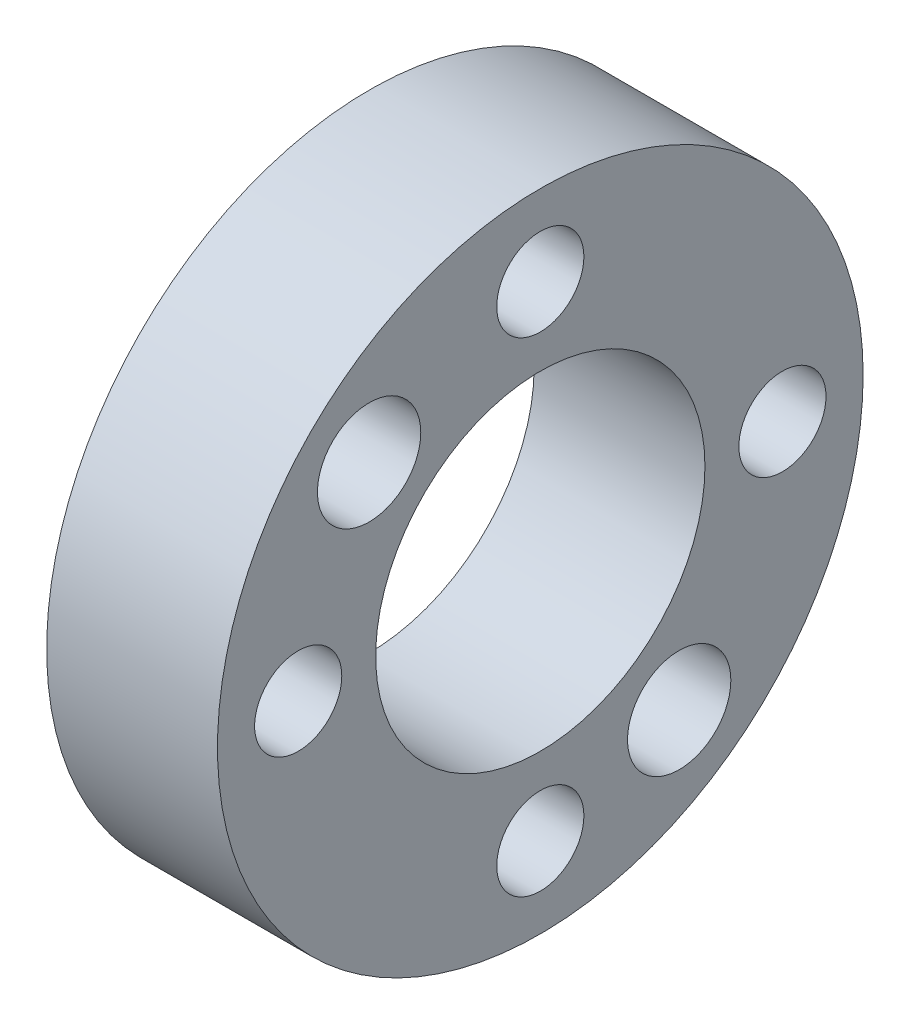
from build123d import *

# Parameters (mm, degrees)
SKIZZE1_W                        = 5.291
SKIZZE1_H                        = 4.9
F_2_7_2_7_DURCHMESSER_BOHRUNG1_D = 2.7
KREISMUSTER1_COUNT               = 4
SKIZZE4_R                        = 1.6
SCHNITT_LINEAR_AUSTRAGEN1_DEPTH  = 16.09949274


with BuildPart() as part:
    # Skizze1 → Rotation1 (revolve)
    with BuildSketch(Plane.XY, mode=Mode.PRIVATE) as rotation1_sk:
        with Locations((2.6455, 7.55)):
            Rectangle(SKIZZE1_W, SKIZZE1_H)
    revolve(rotation1_sk.sketch.rotate(Axis((0, 0, 0), (-1, 0, 0)), 90), axis=Axis((0, 0, 0), (-1, 0, 0)))

    # 2.7 _2.7_ Durchmesser Bohrung1 (through all)
    with Locations(Plane(origin=(5.291, 0, 0), x_dir=(0, 0, -1), z_dir=(1, 0, 0))):
        with Locations((0, 7.5)):
            f_2_7_2_7_durchmesser_bohrung1 = Hole(F_2_7_2_7_DURCHMESSER_BOHRUNG1_D / 2)

    # Kreismuster1: 2.7 _2.7_ Durchmesser Bohrung1 ×4 about axis
    kreismuster1_axis = Axis((0, 0, 0), (1, 0, 0))
    for i in range(1, KREISMUSTER1_COUNT):
        add(f_2_7_2_7_durchmesser_bohrung1.rotate(kreismuster1_axis, i * 360 / KREISMUSTER1_COUNT), mode=Mode.SUBTRACT)

    # Skizze4 → Schnitt-Linear austragen1 (cut, through all)
    with BuildSketch(Plane(origin=(5.291, 0, 0), x_dir=(0, 0, -1), z_dir=(1, 0, 0))):
        with Locations((-5.303300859, 5.303300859)):
            Circle(SKIZZE4_R)
        with Locations((4.301823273, -6.143640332)):
            Circle(SKIZZE4_R)
    extrude(amount=-SCHNITT_LINEAR_AUSTRAGEN1_DEPTH, mode=Mode.SUBTRACT)


solid = part.part
